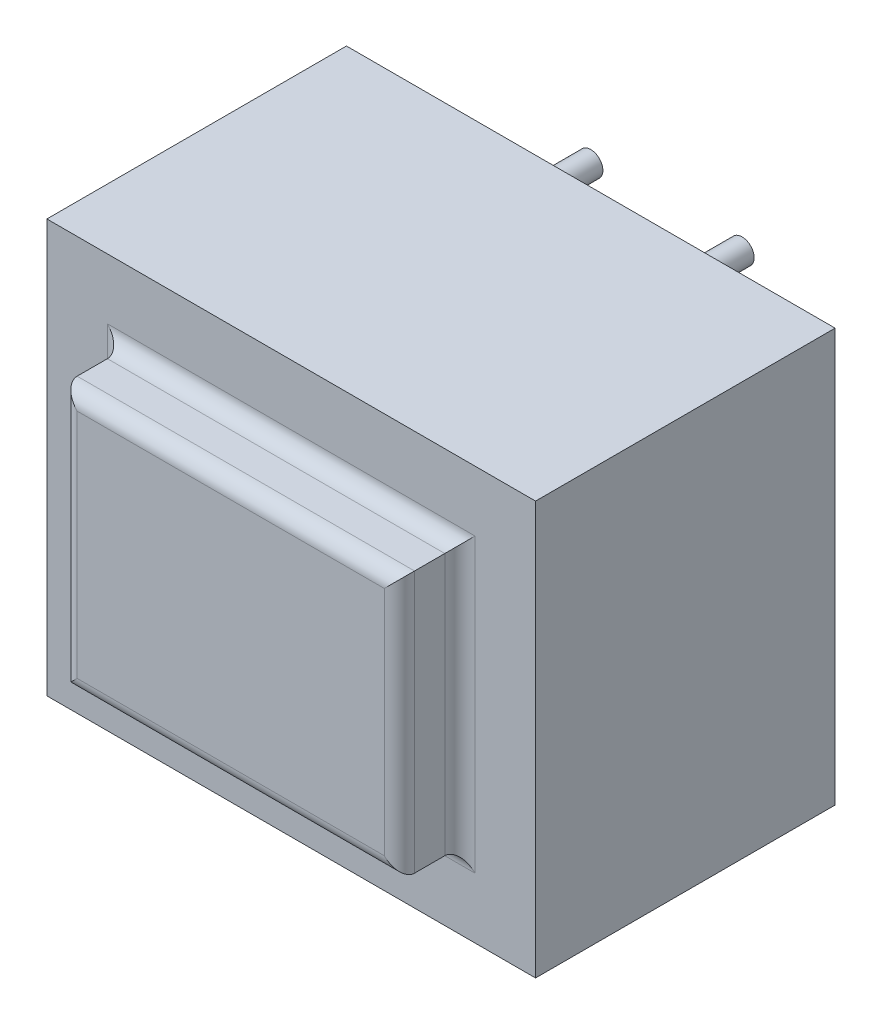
from build123d import *

# Parameters (mm, degrees)
SKETCH1_W           = 32.3
SKETCH1_H           = 27.3
BOSS_EXTRUDE1_DEPTH = 19.8
SKETCH2_W           = 22.3
SKETCH2_H           = 17.3
BOSS_EXTRUDE2_DEPTH = 4
SKETCH4_R           = 0.8
BOSS_EXTRUDE3_DEPTH = 5
FILLET1_R           = 1


with BuildPart() as part:
    # Sketch1 → Boss-Extrude1 (new body)
    with BuildSketch(Plane.XY):
        with Locations((16.15, 13.65)):
            Rectangle(SKETCH1_W, SKETCH1_H)
    extrude(amount=BOSS_EXTRUDE1_DEPTH)

    # Sketch2 → Boss-Extrude2 (add)
    with BuildSketch(Plane.XY.offset(19.8)):
        with Locations((16.15, 13.65)):
            Rectangle(SKETCH2_W, SKETCH2_H)
    extrude(amount=BOSS_EXTRUDE2_DEPTH)

    # Sketch4 → Boss-Extrude3 (add)
    with BuildSketch(Plane(origin=(0, 0, 0), x_dir=(-1, 0, 0), z_dir=(0, 0, -1))):
        with Locations((-6.15, 3.65)):
            Circle(SKETCH4_R)
        with Locations((-26.15, 3.65)):
            Circle(SKETCH4_R)
        with Locations((-11.15, 23.65)):
            Circle(SKETCH4_R)
        with Locations((-21.15, 23.65)):
            Circle(SKETCH4_R)
    extrude(amount=BOSS_EXTRUDE3_DEPTH)

    # Fillet1
    fillet1_edges = [part.edges().sort_by_distance(p)[0] for p in [
        (5, 13.65, 19.8),
        (16.15, 5, 19.8),
        (27.3, 13.65, 19.8),
        (16.15, 22.3, 19.8),
        (5, 13.65, 23.8),
        (16.15, 5, 23.8),
        (27.3, 13.65, 23.8),
        (16.15, 22.3, 23.8),
    ]]
    fillet(fillet1_edges, radius=FILLET1_R)


solid = part.part
